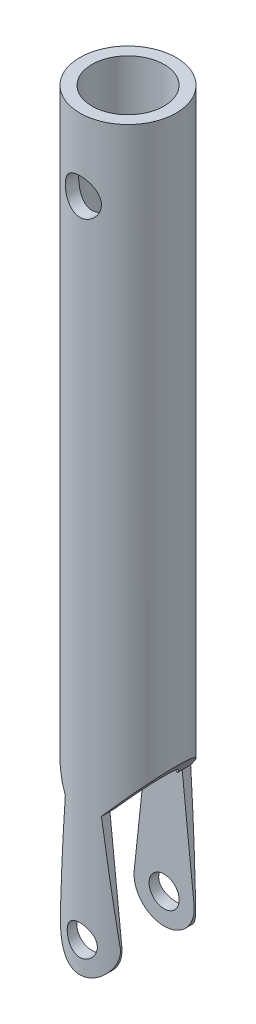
from build123d import *

# Parameters (mm, degrees)
SKETCH1_R           = 4
SKETCH1_R_2         = 3
EXTRUDE1_DEPTH      = 62
EXTRUDE3_DEPTH      = 63.257529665
EXTRUDE3_DEPTH_BACK = 63.257529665
SKETCH3_R           = 1.5
EXTRUDE4_DEPTH      = 63.257529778
EXTRUDE4_DEPTH_BACK = 63.257529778
SKETCH4_R           = 1.25
EXTRUDE5_DEPTH      = 10
EXTRUDE5_DEPTH_BACK = 63.257529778
EXTRUDE6_DEPTH      = 63.257529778
EXTRUDE6_DEPTH_BACK = 63.257529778
SKETCH6_W           = 6
SKETCH6_H           = 15.001629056


with BuildPart() as part:
    # Sketch1 → Extrude1 (new body)
    with BuildSketch(Plane(origin=(0, 0, 0), x_dir=(1, 0, 0), z_dir=(0, 1, 0))):
        with Locations(Location((0, 0, 0), (0, 0, 270))):
            Circle(SKETCH1_R)
        with Locations(Location((0, 0, 0), (0, 0, 270))):
            Circle(SKETCH1_R_2, mode=Mode.SUBTRACT)
    extrude(amount=EXTRUDE1_DEPTH)

    # Sketch3 → Extrude3 (cut, two sides: drawn at the far end of the back side and taken through both)
    with BuildSketch(Plane(origin=(0, 0, 0), x_dir=(1, 0, 0), z_dir=(0, 0, -1)).offset(-EXTRUDE3_DEPTH_BACK)):
        with Locations(Location((0, -56, 0), (0, 0, 270.000000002))):
            Circle(SKETCH3_R)
    extrude(amount=EXTRUDE3_DEPTH + EXTRUDE3_DEPTH_BACK, mode=Mode.SUBTRACT)

    # Sketch4 → Extrude4 (cut, two sides: drawn at the far end of the back side and taken through both)
    with BuildSketch(Plane.XY.offset(-EXTRUDE4_DEPTH_BACK)):
        with Locations((0, 2.5)):
            Circle(SKETCH4_R)
    extrude(amount=EXTRUDE4_DEPTH + EXTRUDE4_DEPTH_BACK, mode=Mode.SUBTRACT)

    # Sketch5 → Extrude5 (cut, two sides: drawn at the far end of the back side and taken through both)
    with BuildSketch(Plane.XY.offset(-EXTRUDE5_DEPTH_BACK)):
        with BuildLine():
            Line((-4, 15), (-1.5, 12))
            Line((-1.5, 12), (-2.485873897, 2.765388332))
            ThreePointArc((-2.485873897, 2.765388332), (0, 0), (2.485873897, 2.765388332))
            Line((2.485873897, 2.765388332), (1.5, 12))
            Line((1.5, 12), (4, 15))
            Line((4, 15), (4, -3.062776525))
            Line((4, -3.062776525), (-4, -3.062776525))
            Line((-4, -3.062776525), (-4, 15))
        make_face()
    extrude(amount=EXTRUDE5_DEPTH + EXTRUDE5_DEPTH_BACK, mode=Mode.SUBTRACT)

    # Sketch6 → Extrude6 (cut, two sides: drawn at the far end of the back side and taken through both)
    with BuildSketch(Plane(origin=(0, 0, 0), x_dir=(0, 0, -1), z_dir=(1, 0, 0)).offset(-EXTRUDE6_DEPTH_BACK)):
        with Locations((0, 4.499185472)):
            Rectangle(SKETCH6_W, SKETCH6_H)
    extrude(amount=EXTRUDE6_DEPTH + EXTRUDE6_DEPTH_BACK, mode=Mode.SUBTRACT)


solid = part.part
